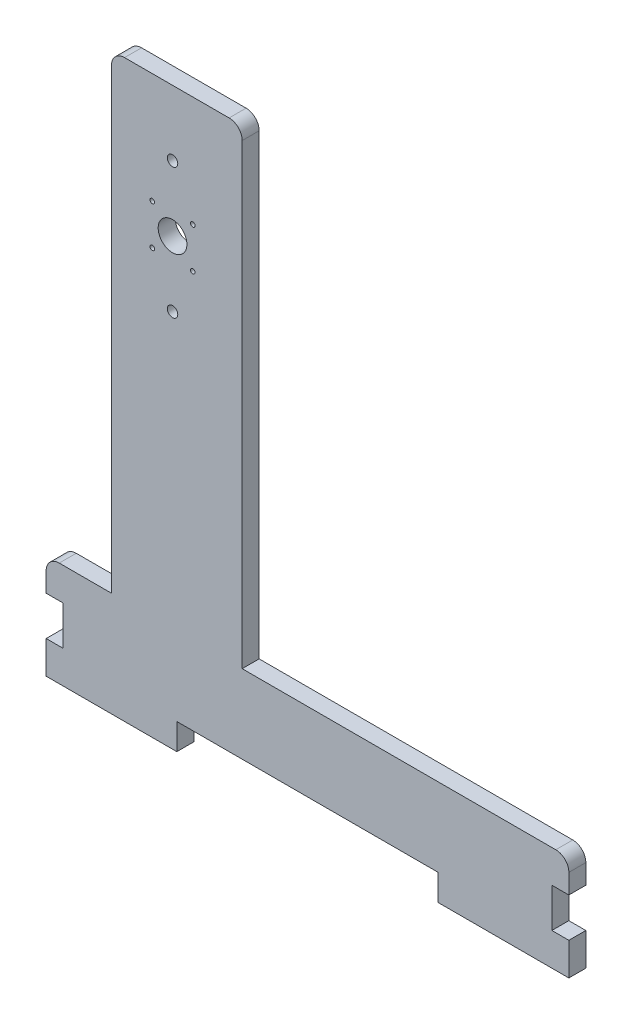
from build123d import *

# Parameters (mm, degrees)
SALIENTE_EXTRUIR1_DEPTH = 13
REDONDEO3_R             = 10
REDONDEO4_R             = 10
REDONDEO5_R             = 10
REDONDEO6_R             = 10
CROQUIS2_R              = 4
CROQUIS2_R_2            = 11
CROQUIS2_R_3            = 1.75
CROQUIS2_W              = 13
CROQUIS2_H              = 30
CORTAR_EXTRUIR1_DEPTH   = 13


with BuildPart() as part:
    # Croquis1 → Saliente-Extruir1 (new body)
    with BuildSketch(Plane.XY):
        Polygon((100, -40), (200, -40), (200, 40), (-50, 40), (-50, 400), (-150, 400), (-150, 40), (-200, 40), (-200, -40), (-100, -40), (-100, -20), (100, -20), align=None)
    extrude(amount=SALIENTE_EXTRUIR1_DEPTH)

    # Redondeo3
    redondeo3_edges = [part.edges().sort_by_distance(p)[0] for p in [
        (-150, 400, 6.5),
    ]]
    fillet(redondeo3_edges, radius=REDONDEO3_R)

    # Redondeo4
    redondeo4_edges = [part.edges().sort_by_distance(p)[0] for p in [
        (-50, 400, 6.5),
    ]]
    fillet(redondeo4_edges, radius=REDONDEO4_R)

    # Redondeo5
    redondeo5_edges = [part.edges().sort_by_distance(p)[0] for p in [
        (200, 40, 6.5),
    ]]
    fillet(redondeo5_edges, radius=REDONDEO5_R)

    # Redondeo6
    redondeo6_edges = [part.edges().sort_by_distance(p)[0] for p in [
        (-200, 40, 6.5),
    ]]
    fillet(redondeo6_edges, radius=REDONDEO6_R)

    # Croquis2 → Cortar-Extruir1 (cut)
    with BuildSketch(Plane.XY.offset(13)):
        with Locations((-103.286771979, 350)):
            Circle(CROQUIS2_R)
        with Locations((-103.286771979, 300)):
            Circle(CROQUIS2_R_2)
        with Locations((-103.286771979, 250)):
            Circle(CROQUIS2_R)
        with Locations((-118.786771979, 315.5)):
            Circle(CROQUIS2_R_3)
        with Locations((-87.786771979, 315.5)):
            Circle(CROQUIS2_R_3)
        with Locations((-87.786771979, 284.5)):
            Circle(CROQUIS2_R_3)
        with Locations((-118.786771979, 284.5)):
            Circle(CROQUIS2_R_3)
        with Locations((193.5, 0)):
            Rectangle(CROQUIS2_W, CROQUIS2_H)
        with Locations((-193.5, 0)):
            Rectangle(CROQUIS2_W, CROQUIS2_H)
    extrude(amount=-CORTAR_EXTRUIR1_DEPTH, mode=Mode.SUBTRACT)


solid = part.part
